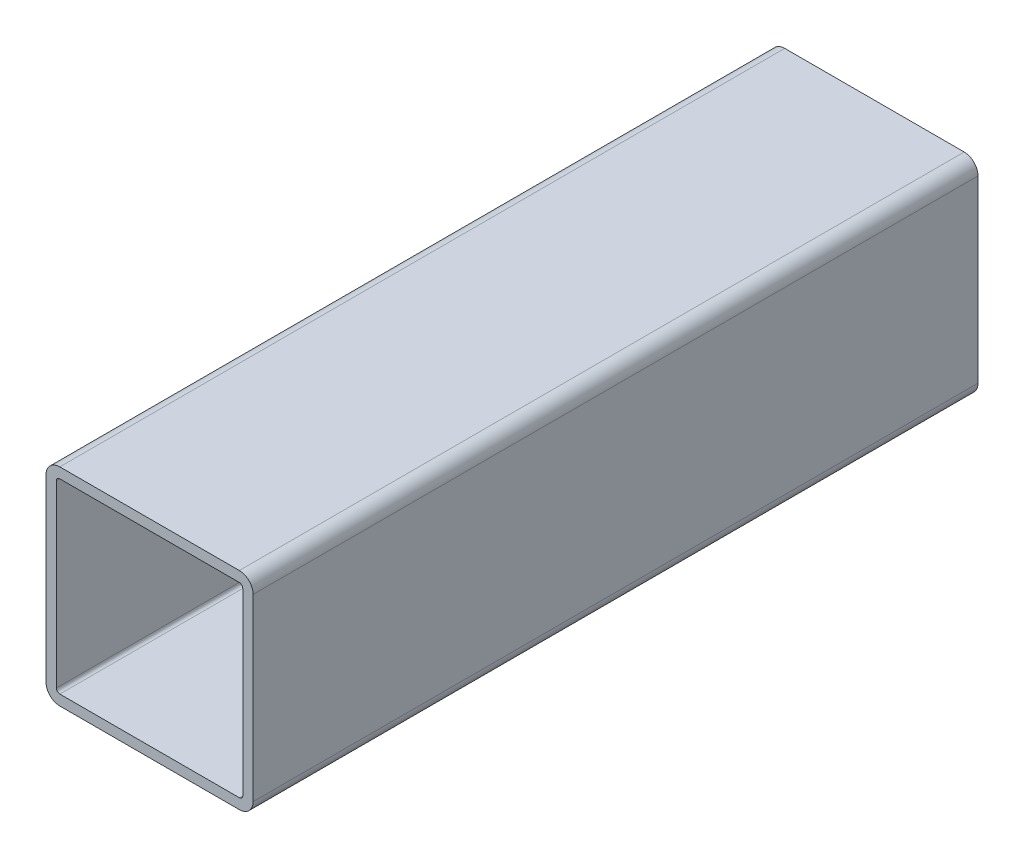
from build123d import *

# Parameters (mm, degrees)
BASE_EXTRUSION_DEPTH = 210


with BuildPart() as part:
    # Esquisse1 → Base-Extrusion (new body)
    with BuildSketch(Plane.XY):
        with BuildLine():
            Line((4, 0), (56, 0))
            ThreePointArc((56, 0), (58.828427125, -1.171572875), (60, -4))
            Line((60, -4), (60, -56))
            ThreePointArc((60, -56), (58.828427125, -58.828427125), (56, -60))
            Line((56, -60), (4, -60))
            ThreePointArc((4, -60), (1.171572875, -58.828427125), (0, -56))
            Line((0, -56), (0, -4))
            ThreePointArc((0, -4), (1.171572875, -1.171572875), (4, 0))
        make_face()
        with BuildLine():
            Line((3, -4), (3, -56))
            ThreePointArc((3, -56), (3.292893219, -56.707106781), (4, -57))
            Line((4, -57), (56, -57))
            ThreePointArc((56, -57), (56.707106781, -56.707106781), (57, -56))
            Line((57, -56), (57, -4))
            ThreePointArc((57, -4), (56.707106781, -3.292893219), (56, -3))
            Line((56, -3), (4, -3))
            ThreePointArc((4, -3), (3.292893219, -3.292893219), (3, -4))
        make_face(mode=Mode.SUBTRACT)
    extrude(amount=BASE_EXTRUSION_DEPTH)


solid = part.part
